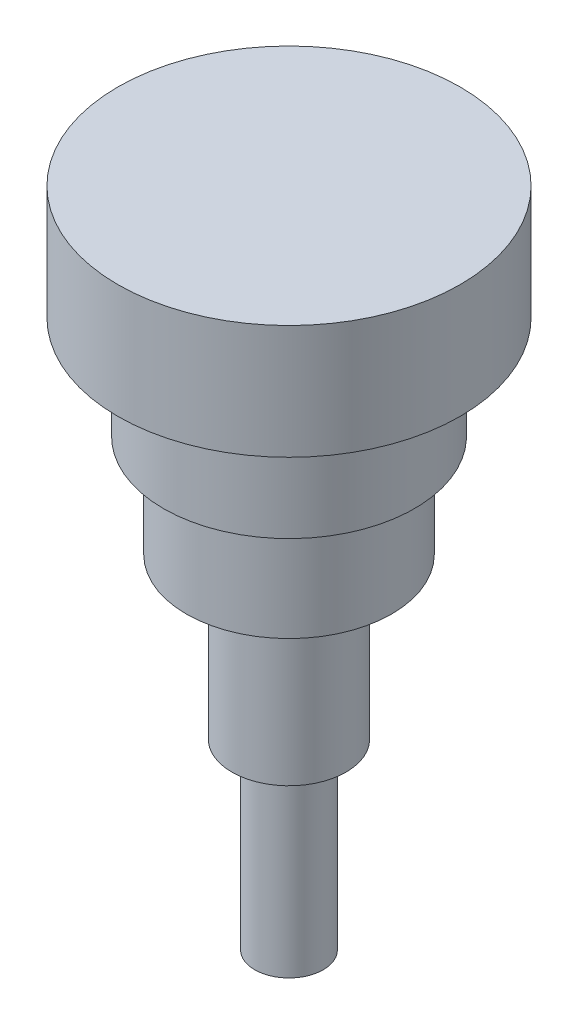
ISO-10303-21;
HEADER;
FILE_DESCRIPTION(('STEP AP214'),'2;1');
FILE_NAME('part.step','',(''),(''),'','','');
FILE_SCHEMA(('AUTOMOTIVE_DESIGN { 1 0 10303 214 1 1 1 1 }'));
ENDSEC;
DATA;
#1=APPLICATION_CONTEXT('core data for automotive mechanical design processes');
#2=APPLICATION_PROTOCOL_DEFINITION('international standard','automotive_design',2000,#1);
#3=PRODUCT_CONTEXT('',#1,'mechanical');
#4=PRODUCT('Part','Part','',(#3));
#5=PRODUCT_RELATED_PRODUCT_CATEGORY('part','',(#4));
#6=PRODUCT_DEFINITION_FORMATION('','',#4);
#7=PRODUCT_DEFINITION_CONTEXT('part definition',#1,'design');
#8=PRODUCT_DEFINITION('design','',#6,#7);
#9=PRODUCT_DEFINITION_SHAPE('','',#8);
#10=(LENGTH_UNIT() NAMED_UNIT(*) SI_UNIT(.MILLI.,.METRE.));
#11=(NAMED_UNIT(*) PLANE_ANGLE_UNIT() SI_UNIT($,.RADIAN.));
#12=(NAMED_UNIT(*) SI_UNIT($,.STERADIAN.) SOLID_ANGLE_UNIT());
#13=UNCERTAINTY_MEASURE_WITH_UNIT(LENGTH_MEASURE(1.E-05),#10,'distance_accuracy_value','');
#14=(GEOMETRIC_REPRESENTATION_CONTEXT(3) GLOBAL_UNCERTAINTY_ASSIGNED_CONTEXT((#13)) GLOBAL_UNIT_ASSIGNED_CONTEXT((#10,
#11,#12)) REPRESENTATION_CONTEXT('',''));
#15=CARTESIAN_POINT('',(0.,0.,0.));
#16=DIRECTION('',(0.,0.,1.));
#17=DIRECTION('',(1.,0.,0.));
#18=AXIS2_PLACEMENT_3D('',#15,#16,#17);
#19=CARTESIAN_POINT('',(-15.,156.,0.));
#20=DIRECTION('',(0.,1.,0.));
#21=DIRECTION('',(0.,0.,1.));
#22=AXIS2_PLACEMENT_3D('',#19,#20,#21);
#23=PLANE('',#22);
#24=CARTESIAN_POINT('',(0.,156.,0.));
#25=DIRECTION('',(0.,1.,0.));
#26=DIRECTION('',(0.,0.,1.));
#27=AXIS2_PLACEMENT_3D('',#24,#25,#26);
#28=CIRCLE('',#27,15.);
#29=CARTESIAN_POINT('',(0.,156.,15.));
#30=VERTEX_POINT('',#29);
#31=EDGE_CURVE('E10',#30,#30,#28,.T.);
#32=ORIENTED_EDGE('',*,*,#31,.T.);
#33=EDGE_LOOP('',(#32));
#34=FACE_BOUND('',#33,.T.);
#35=ADVANCED_FACE('F29',(#34),#23,.T.);
#36=CARTESIAN_POINT('',(0.,128.,0.));
#37=DIRECTION('',(0.,1.,0.));
#38=DIRECTION('',(0.,0.,1.));
#39=AXIS2_PLACEMENT_3D('',#36,#37,#38);
#40=CYLINDRICAL_SURFACE('',#39,15.);
#41=CARTESIAN_POINT('',(0.,146.,0.));
#42=DIRECTION('',(0.,1.,0.));
#43=DIRECTION('',(0.,0.,1.));
#44=AXIS2_PLACEMENT_3D('',#41,#42,#43);
#45=CIRCLE('',#44,15.);
#46=CARTESIAN_POINT('',(0.,146.,15.));
#47=VERTEX_POINT('',#46);
#48=EDGE_CURVE('E35',#47,#47,#45,.T.);
#49=ORIENTED_EDGE('',*,*,#48,.T.);
#50=EDGE_LOOP('',(#49));
#51=FACE_BOUND('',#50,.T.);
#52=ORIENTED_EDGE('',*,*,#31,.F.);
#53=EDGE_LOOP('',(#52));
#54=FACE_BOUND('',#53,.T.);
#55=ADVANCED_FACE('F79',(#51,#54),#40,.T.);
#56=CARTESIAN_POINT('',(-15.,146.,0.));
#57=DIRECTION('',(0.,-1.,0.));
#58=DIRECTION('',(0.,0.,-1.));
#59=AXIS2_PLACEMENT_3D('',#56,#57,#58);
#60=PLANE('',#59);
#61=CARTESIAN_POINT('',(0.,146.,0.));
#62=DIRECTION('',(0.,1.,0.));
#63=DIRECTION('',(0.,0.,1.));
#64=AXIS2_PLACEMENT_3D('',#61,#62,#63);
#65=CIRCLE('',#64,11.);
#66=CARTESIAN_POINT('',(0.,146.,11.));
#67=VERTEX_POINT('',#66);
#68=EDGE_CURVE('E39',#67,#67,#65,.T.);
#69=ORIENTED_EDGE('',*,*,#68,.T.);
#70=EDGE_LOOP('',(#69));
#71=FACE_BOUND('',#70,.T.);
#72=ORIENTED_EDGE('',*,*,#48,.F.);
#73=EDGE_LOOP('',(#72));
#74=FACE_BOUND('',#73,.T.);
#75=ADVANCED_FACE('F83',(#71,#74),#60,.T.);
#76=CARTESIAN_POINT('',(0.,128.,0.));
#77=DIRECTION('',(0.,1.,0.));
#78=DIRECTION('',(0.,0.,1.));
#79=AXIS2_PLACEMENT_3D('',#76,#77,#78);
#80=CYLINDRICAL_SURFACE('',#79,11.);
#81=CARTESIAN_POINT('',(0.,137.,0.));
#82=DIRECTION('',(0.,1.,0.));
#83=DIRECTION('',(0.,0.,1.));
#84=AXIS2_PLACEMENT_3D('',#81,#82,#83);
#85=CIRCLE('',#84,11.);
#86=CARTESIAN_POINT('',(0.,137.,11.));
#87=VERTEX_POINT('',#86);
#88=EDGE_CURVE('E43',#87,#87,#85,.T.);
#89=ORIENTED_EDGE('',*,*,#88,.T.);
#90=EDGE_LOOP('',(#89));
#91=FACE_BOUND('',#90,.T.);
#92=ORIENTED_EDGE('',*,*,#68,.F.);
#93=EDGE_LOOP('',(#92));
#94=FACE_BOUND('',#93,.T.);
#95=ADVANCED_FACE('F87',(#91,#94),#80,.T.);
#96=CARTESIAN_POINT('',(-9.,137.,0.));
#97=DIRECTION('',(0.,-1.,0.));
#98=DIRECTION('',(0.,0.,-1.));
#99=AXIS2_PLACEMENT_3D('',#96,#97,#98);
#100=PLANE('',#99);
#101=CARTESIAN_POINT('',(0.,137.,0.));
#102=DIRECTION('',(0.,1.,0.));
#103=DIRECTION('',(0.,0.,1.));
#104=AXIS2_PLACEMENT_3D('',#101,#102,#103);
#105=CIRCLE('',#104,9.);
#106=CARTESIAN_POINT('',(0.,137.,9.));
#107=VERTEX_POINT('',#106);
#108=EDGE_CURVE('E48',#107,#107,#105,.T.);
#109=ORIENTED_EDGE('',*,*,#108,.T.);
#110=EDGE_LOOP('',(#109));
#111=FACE_BOUND('',#110,.T.);
#112=ORIENTED_EDGE('',*,*,#88,.F.);
#113=EDGE_LOOP('',(#112));
#114=FACE_BOUND('',#113,.T.);
#115=ADVANCED_FACE('F94',(#111,#114),#100,.T.);
#116=CARTESIAN_POINT('',(0.,128.,0.));
#117=DIRECTION('',(0.,1.,0.));
#118=DIRECTION('',(0.,0.,1.));
#119=AXIS2_PLACEMENT_3D('',#116,#117,#118);
#120=CYLINDRICAL_SURFACE('',#119,9.);
#121=CARTESIAN_POINT('',(0.,128.,0.));
#122=DIRECTION('',(0.,1.,0.));
#123=DIRECTION('',(0.,0.,1.));
#124=AXIS2_PLACEMENT_3D('',#121,#122,#123);
#125=CIRCLE('',#124,9.);
#126=CARTESIAN_POINT('',(0.,128.,9.));
#127=VERTEX_POINT('',#126);
#128=EDGE_CURVE('E51',#127,#127,#125,.T.);
#129=ORIENTED_EDGE('',*,*,#128,.T.);
#130=EDGE_LOOP('',(#129));
#131=FACE_BOUND('',#130,.T.);
#132=ORIENTED_EDGE('',*,*,#108,.F.);
#133=EDGE_LOOP('',(#132));
#134=FACE_BOUND('',#133,.T.);
#135=ADVANCED_FACE('F98',(#131,#134),#120,.T.);
#136=CARTESIAN_POINT('',(-5.,128.,0.));
#137=DIRECTION('',(0.,-1.,0.));
#138=DIRECTION('',(0.,0.,-1.));
#139=AXIS2_PLACEMENT_3D('',#136,#137,#138);
#140=PLANE('',#139);
#141=CARTESIAN_POINT('',(0.,128.,0.));
#142=DIRECTION('',(0.,1.,0.));
#143=DIRECTION('',(0.,0.,1.));
#144=AXIS2_PLACEMENT_3D('',#141,#142,#143);
#145=CIRCLE('',#144,5.);
#146=CARTESIAN_POINT('',(0.,128.,5.));
#147=VERTEX_POINT('',#146);
#148=EDGE_CURVE('E54',#147,#147,#145,.T.);
#149=ORIENTED_EDGE('',*,*,#148,.T.);
#150=EDGE_LOOP('',(#149));
#151=FACE_BOUND('',#150,.T.);
#152=ORIENTED_EDGE('',*,*,#128,.F.);
#153=EDGE_LOOP('',(#152));
#154=FACE_BOUND('',#153,.T.);
#155=ADVANCED_FACE('F102',(#151,#154),#140,.T.);
#156=CARTESIAN_POINT('',(0.,128.,0.));
#157=DIRECTION('',(0.,1.,0.));
#158=DIRECTION('',(0.,0.,1.));
#159=AXIS2_PLACEMENT_3D('',#156,#157,#158);
#160=CYLINDRICAL_SURFACE('',#159,5.);
#161=CARTESIAN_POINT('',(0.,114.,0.));
#162=DIRECTION('',(0.,1.,0.));
#163=DIRECTION('',(0.,0.,1.));
#164=AXIS2_PLACEMENT_3D('',#161,#162,#163);
#165=CIRCLE('',#164,5.);
#166=CARTESIAN_POINT('',(0.,114.,5.));
#167=VERTEX_POINT('',#166);
#168=EDGE_CURVE('E57',#167,#167,#165,.T.);
#169=ORIENTED_EDGE('',*,*,#168,.T.);
#170=EDGE_LOOP('',(#169));
#171=FACE_BOUND('',#170,.T.);
#172=ORIENTED_EDGE('',*,*,#148,.F.);
#173=EDGE_LOOP('',(#172));
#174=FACE_BOUND('',#173,.T.);
#175=ADVANCED_FACE('F106',(#171,#174),#160,.T.);
#176=CARTESIAN_POINT('',(-3.,114.,0.));
#177=DIRECTION('',(0.,-1.,0.));
#178=DIRECTION('',(0.,0.,-1.));
#179=AXIS2_PLACEMENT_3D('',#176,#177,#178);
#180=PLANE('',#179);
#181=CARTESIAN_POINT('',(0.,114.,0.));
#182=DIRECTION('',(0.,1.,0.));
#183=DIRECTION('',(0.,0.,1.));
#184=AXIS2_PLACEMENT_3D('',#181,#182,#183);
#185=CIRCLE('',#184,3.);
#186=CARTESIAN_POINT('',(0.,114.,3.));
#187=VERTEX_POINT('',#186);
#188=EDGE_CURVE('E60',#187,#187,#185,.T.);
#189=ORIENTED_EDGE('',*,*,#188,.T.);
#190=EDGE_LOOP('',(#189));
#191=FACE_BOUND('',#190,.T.);
#192=ORIENTED_EDGE('',*,*,#168,.F.);
#193=EDGE_LOOP('',(#192));
#194=FACE_BOUND('',#193,.T.);
#195=ADVANCED_FACE('F76',(#191,#194),#180,.T.);
#196=CARTESIAN_POINT('',(0.,128.,0.));
#197=DIRECTION('',(0.,1.,0.));
#198=DIRECTION('',(0.,0.,1.));
#199=AXIS2_PLACEMENT_3D('',#196,#197,#198);
#200=CYLINDRICAL_SURFACE('',#199,3.);
#201=CARTESIAN_POINT('',(0.,98.,0.));
#202=DIRECTION('',(0.,1.,0.));
#203=DIRECTION('',(0.,0.,1.));
#204=AXIS2_PLACEMENT_3D('',#201,#202,#203);
#205=CIRCLE('',#204,3.);
#206=CARTESIAN_POINT('',(0.,98.,3.));
#207=VERTEX_POINT('',#206);
#208=EDGE_CURVE('E63',#207,#207,#205,.T.);
#209=ORIENTED_EDGE('',*,*,#208,.T.);
#210=EDGE_LOOP('',(#209));
#211=FACE_BOUND('',#210,.T.);
#212=ORIENTED_EDGE('',*,*,#188,.F.);
#213=EDGE_LOOP('',(#212));
#214=FACE_BOUND('',#213,.T.);
#215=ADVANCED_FACE('F67',(#211,#214),#200,.T.);
#216=CARTESIAN_POINT('',(0.,98.,0.));
#217=DIRECTION('',(0.,-1.,0.));
#218=DIRECTION('',(0.,0.,-1.));
#219=AXIS2_PLACEMENT_3D('',#216,#217,#218);
#220=PLANE('',#219);
#221=ORIENTED_EDGE('',*,*,#208,.F.);
#222=EDGE_LOOP('',(#221));
#223=FACE_BOUND('',#222,.T.);
#224=ADVANCED_FACE('F70',(#223),#220,.T.);
#225=CLOSED_SHELL('',(#35,#55,#75,#95,#115,#135,#155,#175,#195,#215,#224));
#226=MANIFOLD_SOLID_BREP('B2',#225);
#227=ADVANCED_BREP_SHAPE_REPRESENTATION('',(#18,#226),#14);
#228=SHAPE_DEFINITION_REPRESENTATION(#9,#227);
ENDSEC;
END-ISO-10303-21;
